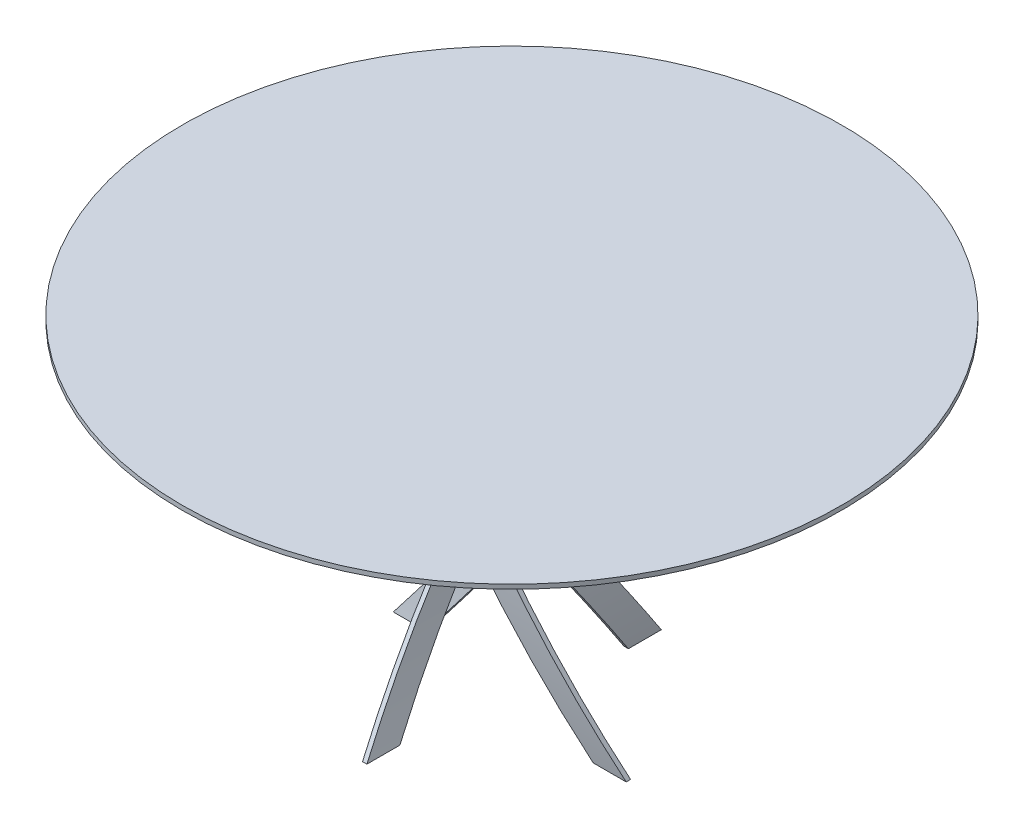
ISO-10303-21;
HEADER;
FILE_DESCRIPTION(('STEP AP214'),'2;1');
FILE_NAME('part.step','',(''),(''),'','','');
FILE_SCHEMA(('AUTOMOTIVE_DESIGN { 1 0 10303 214 1 1 1 1 }'));
ENDSEC;
DATA;
#1=APPLICATION_CONTEXT('core data for automotive mechanical design processes');
#2=APPLICATION_PROTOCOL_DEFINITION('international standard','automotive_design',2000,#1);
#3=PRODUCT_CONTEXT('',#1,'mechanical');
#4=PRODUCT('Part','Part','',(#3));
#5=PRODUCT_RELATED_PRODUCT_CATEGORY('part','',(#4));
#6=PRODUCT_DEFINITION_FORMATION('','',#4);
#7=PRODUCT_DEFINITION_CONTEXT('part definition',#1,'design');
#8=PRODUCT_DEFINITION('design','',#6,#7);
#9=PRODUCT_DEFINITION_SHAPE('','',#8);
#10=(LENGTH_UNIT() NAMED_UNIT(*) SI_UNIT(.MILLI.,.METRE.));
#11=(NAMED_UNIT(*) PLANE_ANGLE_UNIT() SI_UNIT($,.RADIAN.));
#12=(NAMED_UNIT(*) SI_UNIT($,.STERADIAN.) SOLID_ANGLE_UNIT());
#13=UNCERTAINTY_MEASURE_WITH_UNIT(LENGTH_MEASURE(1.E-05),#10,'distance_accuracy_value','');
#14=(GEOMETRIC_REPRESENTATION_CONTEXT(3) GLOBAL_UNCERTAINTY_ASSIGNED_CONTEXT((#13)) GLOBAL_UNIT_ASSIGNED_CONTEXT((#10,
#11,#12)) REPRESENTATION_CONTEXT('',''));
#15=CARTESIAN_POINT('',(0.,0.,0.));
#16=DIRECTION('',(0.,0.,1.));
#17=DIRECTION('',(1.,0.,0.));
#18=AXIS2_PLACEMENT_3D('',#15,#16,#17);
#19=CARTESIAN_POINT('',(-300.000000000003,-1.11022302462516E-13,299.999999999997));
#20=DIRECTION('',(0.,0.589469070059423,0.807790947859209));
#21=DIRECTION('',(0.,-0.807790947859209,0.589469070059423));
#22=AXIS2_PLACEMENT_3D('',#19,#20,#21);
#23=PLANE('',#22);
#24=DIRECTION('',(1.,0.,0.));
#25=VECTOR('',#24,1.);
#26=CARTESIAN_POINT('',(-299.999999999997,740.,-240.000000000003));
#27=LINE('',#26,#25);
#28=CARTESIAN_POINT('',(-39.9999999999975,740.,-240.));
#29=VERTEX_POINT('',#28);
#30=CARTESIAN_POINT('',(-29.9999999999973,740.,-240.));
#31=VERTEX_POINT('',#30);
#32=EDGE_CURVE('E109',#29,#31,#27,.T.);
#33=ORIENTED_EDGE('',*,*,#32,.F.);
#34=CARTESIAN_POINT('',(1721.56180703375,370.,30.0000000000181));
#35=DIRECTION('',(0.,0.589469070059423,0.807790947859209));
#36=DIRECTION('',(0.,0.807790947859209,-0.589469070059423));
#37=AXIS2_PLACEMENT_3D('',#34,#35,#36);
#38=ELLIPSE('',#37,2228.29929546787,1800.);
#39=CARTESIAN_POINT('',(-40.0000000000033,-1.11022302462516E-13,300.));
#40=VERTEX_POINT('',#39);
#41=EDGE_CURVE('E91',#29,#40,#38,.T.);
#42=ORIENTED_EDGE('',*,*,#41,.T.);
#43=DIRECTION('',(1.,0.,0.));
#44=VECTOR('',#43,1.);
#45=CARTESIAN_POINT('',(-300.000000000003,-1.11022302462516E-13,299.999999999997));
#46=LINE('',#45,#44);
#47=CARTESIAN_POINT('',(-30.0000000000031,-1.11022302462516E-13,300.));
#48=VERTEX_POINT('',#47);
#49=EDGE_CURVE('E111',#40,#48,#46,.T.);
#50=ORIENTED_EDGE('',*,*,#49,.T.);
#51=CARTESIAN_POINT('',(1731.56180703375,370.,30.0000000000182));
#52=DIRECTION('',(0.,0.589469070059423,0.807790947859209));
#53=DIRECTION('',(0.,0.807790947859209,-0.589469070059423));
#54=AXIS2_PLACEMENT_3D('',#51,#52,#53);
#55=ELLIPSE('',#54,2228.29929546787,1800.);
#56=EDGE_CURVE('E96',#48,#31,#55,.F.);
#57=ORIENTED_EDGE('',*,*,#56,.T.);
#58=EDGE_LOOP('',(#33,#42,#50,#57));
#59=FACE_BOUND('',#58,.T.);
#60=ADVANCED_FACE('F46',(#59),#23,.T.);
#61=CARTESIAN_POINT('',(1721.56180703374,370.,500.000000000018));
#62=DIRECTION('',(0.,0.,-1.));
#63=DIRECTION('',(-1.,0.,0.));
#64=AXIS2_PLACEMENT_3D('',#61,#62,#63);
#65=CYLINDRICAL_SURFACE('',#64,1800.);
#66=ORIENTED_EDGE('',*,*,#41,.F.);
#67=CARTESIAN_POINT('',(1721.56180703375,370.,-239.999999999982));
#68=DIRECTION('',(0.,0.,-1.));
#69=DIRECTION('',(0.,1.,0.));
#70=AXIS2_PLACEMENT_3D('',#67,#68,#69);
#71=CIRCLE('',#70,1800.);
#72=CARTESIAN_POINT('',(-58.4922044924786,637.222222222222,-240.000000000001));
#73=VERTEX_POINT('',#72);
#74=EDGE_CURVE('E87',#73,#29,#71,.T.);
#75=ORIENTED_EDGE('',*,*,#74,.F.);
#76=CARTESIAN_POINT('',(1721.56180703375,370.,-44.9999999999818));
#77=DIRECTION('',(0.,-0.589469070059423,-0.807790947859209));
#78=DIRECTION('',(0.,0.807790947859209,-0.589469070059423));
#79=AXIS2_PLACEMENT_3D('',#76,#77,#78);
#80=ELLIPSE('',#79,2228.29929546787,1800.);
#81=CARTESIAN_POINT('',(-40.0000000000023,-1.11022302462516E-13,225.));
#82=VERTEX_POINT('',#81);
#83=EDGE_CURVE('E50',#82,#73,#80,.T.);
#84=ORIENTED_EDGE('',*,*,#83,.F.);
#85=DIRECTION('',(0.,0.,-1.));
#86=VECTOR('',#85,1.);
#87=CARTESIAN_POINT('',(-40.0000000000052,0.,500.));
#88=LINE('',#87,#86);
#89=EDGE_CURVE('E70',#40,#82,#88,.T.);
#90=ORIENTED_EDGE('',*,*,#89,.F.);
#91=EDGE_LOOP('',(#66,#75,#84,#90));
#92=FACE_BOUND('',#91,.T.);
#93=ADVANCED_FACE('F89',(#92),#65,.T.);
#94=CARTESIAN_POINT('',(-299.999999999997,637.222222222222,-240.000000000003));
#95=DIRECTION('',(0.,-0.589469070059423,-0.807790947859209));
#96=DIRECTION('',(0.,0.807790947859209,-0.589469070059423));
#97=AXIS2_PLACEMENT_3D('',#94,#95,#96);
#98=PLANE('',#97);
#99=DIRECTION('',(1.,0.,0.));
#100=VECTOR('',#99,1.);
#101=CARTESIAN_POINT('',(-300.000000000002,-1.11022302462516E-13,224.999999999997));
#102=LINE('',#101,#100);
#103=CARTESIAN_POINT('',(-30.0000000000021,-1.11022302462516E-13,225.));
#104=VERTEX_POINT('',#103);
#105=EDGE_CURVE('E12',#82,#104,#102,.T.);
#106=ORIENTED_EDGE('',*,*,#105,.F.);
#107=ORIENTED_EDGE('',*,*,#83,.T.);
#108=DIRECTION('',(1.,0.,0.));
#109=VECTOR('',#108,1.);
#110=CARTESIAN_POINT('',(-299.999999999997,637.222222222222,-240.000000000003));
#111=LINE('',#110,#109);
#112=CARTESIAN_POINT('',(-48.4922044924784,637.222222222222,-240.));
#113=VERTEX_POINT('',#112);
#114=EDGE_CURVE('E55',#73,#113,#111,.T.);
#115=ORIENTED_EDGE('',*,*,#114,.T.);
#116=CARTESIAN_POINT('',(1731.56180703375,370.,-44.9999999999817));
#117=DIRECTION('',(0.,-0.589469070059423,-0.807790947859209));
#118=DIRECTION('',(0.,0.807790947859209,-0.589469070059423));
#119=AXIS2_PLACEMENT_3D('',#116,#117,#118);
#120=ELLIPSE('',#119,2228.29929546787,1800.);
#121=EDGE_CURVE('E101',#113,#104,#120,.F.);
#122=ORIENTED_EDGE('',*,*,#121,.T.);
#123=EDGE_LOOP('',(#106,#107,#115,#122));
#124=FACE_BOUND('',#123,.T.);
#125=ADVANCED_FACE('F48',(#124),#98,.T.);
#126=CARTESIAN_POINT('',(-299.999999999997,740.,-240.000000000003));
#127=DIRECTION('',(0.,0.,-1.));
#128=DIRECTION('',(0.,1.,0.));
#129=AXIS2_PLACEMENT_3D('',#126,#127,#128);
#130=PLANE('',#129);
#131=ORIENTED_EDGE('',*,*,#114,.F.);
#132=ORIENTED_EDGE('',*,*,#74,.T.);
#133=ORIENTED_EDGE('',*,*,#32,.T.);
#134=CARTESIAN_POINT('',(1731.56180703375,370.,-239.999999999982));
#135=DIRECTION('',(0.,0.,-1.));
#136=DIRECTION('',(0.,1.,0.));
#137=AXIS2_PLACEMENT_3D('',#134,#135,#136);
#138=CIRCLE('',#137,1800.);
#139=EDGE_CURVE('E97',#31,#113,#138,.F.);
#140=ORIENTED_EDGE('',*,*,#139,.T.);
#141=EDGE_LOOP('',(#131,#132,#133,#140));
#142=FACE_BOUND('',#141,.T.);
#143=ADVANCED_FACE('F102',(#142),#130,.T.);
#144=CARTESIAN_POINT('',(1731.56180703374,370.,500.000000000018));
#145=DIRECTION('',(0.,0.,-1.));
#146=DIRECTION('',(-1.,0.,0.));
#147=AXIS2_PLACEMENT_3D('',#144,#145,#146);
#148=CYLINDRICAL_SURFACE('',#147,1800.);
#149=ORIENTED_EDGE('',*,*,#56,.F.);
#150=DIRECTION('',(0.,0.,-1.));
#151=VECTOR('',#150,1.);
#152=CARTESIAN_POINT('',(-30.0000000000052,0.,500.));
#153=LINE('',#152,#151);
#154=EDGE_CURVE('E62',#48,#104,#153,.T.);
#155=ORIENTED_EDGE('',*,*,#154,.T.);
#156=ORIENTED_EDGE('',*,*,#121,.F.);
#157=ORIENTED_EDGE('',*,*,#139,.F.);
#158=EDGE_LOOP('',(#149,#155,#156,#157));
#159=FACE_BOUND('',#158,.T.);
#160=ADVANCED_FACE('F122',(#159),#148,.F.);
#161=CARTESIAN_POINT('',(-300.000000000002,-1.11022302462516E-13,224.999999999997));
#162=DIRECTION('',(0.,-1.,0.));
#163=DIRECTION('',(-1.,0.,0.));
#164=AXIS2_PLACEMENT_3D('',#161,#162,#163);
#165=PLANE('',#164);
#166=ORIENTED_EDGE('',*,*,#49,.F.);
#167=ORIENTED_EDGE('',*,*,#89,.T.);
#168=ORIENTED_EDGE('',*,*,#105,.T.);
#169=ORIENTED_EDGE('',*,*,#154,.F.);
#170=EDGE_LOOP('',(#166,#167,#168,#169));
#171=FACE_BOUND('',#170,.T.);
#172=ADVANCED_FACE('F119',(#171),#165,.T.);
#173=CLOSED_SHELL('',(#60,#93,#125,#143,#160,#172));
#174=MANIFOLD_SOLID_BREP('B2',#173);
#175=CARTESIAN_POINT('',(300.,-1.11022302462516E-13,300.));
#176=DIRECTION('',(0.807790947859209,0.589469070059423,0.));
#177=DIRECTION('',(0.589469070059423,-0.807790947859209,0.));
#178=AXIS2_PLACEMENT_3D('',#175,#176,#177);
#179=PLANE('',#178);
#180=DIRECTION('',(0.,0.,-1.));
#181=VECTOR('',#180,1.);
#182=CARTESIAN_POINT('',(-240.,740.,300.));
#183=LINE('',#182,#181);
#184=CARTESIAN_POINT('',(-240.,740.,40.));
#185=VERTEX_POINT('',#184);
#186=CARTESIAN_POINT('',(-240.,740.,29.9999999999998));
#187=VERTEX_POINT('',#186);
#188=EDGE_CURVE('E255',#185,#187,#183,.T.);
#189=ORIENTED_EDGE('',*,*,#188,.F.);
#190=CARTESIAN_POINT('',(30.,370.,-1721.56180703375));
#191=DIRECTION('',(0.807790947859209,0.589469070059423,0.));
#192=DIRECTION('',(-0.589469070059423,0.807790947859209,0.));
#193=AXIS2_PLACEMENT_3D('',#190,#191,#192);
#194=ELLIPSE('',#193,2228.29929546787,1800.);
#195=CARTESIAN_POINT('',(300.,-1.11022302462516E-13,40.0000000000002));
#196=VERTEX_POINT('',#195);
#197=EDGE_CURVE('E237',#185,#196,#194,.T.);
#198=ORIENTED_EDGE('',*,*,#197,.T.);
#199=DIRECTION('',(0.,0.,-1.));
#200=VECTOR('',#199,1.);
#201=CARTESIAN_POINT('',(300.,-1.11022302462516E-13,300.));
#202=LINE('',#201,#200);
#203=CARTESIAN_POINT('',(300.,-1.11022302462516E-13,30.));
#204=VERTEX_POINT('',#203);
#205=EDGE_CURVE('E257',#196,#204,#202,.T.);
#206=ORIENTED_EDGE('',*,*,#205,.T.);
#207=CARTESIAN_POINT('',(30.,370.,-1731.56180703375));
#208=DIRECTION('',(0.807790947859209,0.589469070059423,0.));
#209=DIRECTION('',(-0.589469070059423,0.807790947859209,0.));
#210=AXIS2_PLACEMENT_3D('',#207,#208,#209);
#211=ELLIPSE('',#210,2228.29929546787,1800.);
#212=EDGE_CURVE('E242',#204,#187,#211,.F.);
#213=ORIENTED_EDGE('',*,*,#212,.T.);
#214=EDGE_LOOP('',(#189,#198,#206,#213));
#215=FACE_BOUND('',#214,.T.);
#216=ADVANCED_FACE('F192',(#215),#179,.T.);
#217=CARTESIAN_POINT('',(500.,370.,-1721.56180703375));
#218=DIRECTION('',(-1.,0.,0.));
#219=DIRECTION('',(0.,0.,1.));
#220=AXIS2_PLACEMENT_3D('',#217,#218,#219);
#221=CYLINDRICAL_SURFACE('',#220,1800.);
#222=ORIENTED_EDGE('',*,*,#197,.F.);
#223=CARTESIAN_POINT('',(-240.,370.,-1721.56180703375));
#224=DIRECTION('',(-1.,0.,0.));
#225=DIRECTION('',(0.,1.,0.));
#226=AXIS2_PLACEMENT_3D('',#223,#224,#225);
#227=CIRCLE('',#226,1800.);
#228=CARTESIAN_POINT('',(-240.,637.222222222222,58.4922044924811));
#229=VERTEX_POINT('',#228);
#230=EDGE_CURVE('E233',#229,#185,#227,.T.);
#231=ORIENTED_EDGE('',*,*,#230,.F.);
#232=CARTESIAN_POINT('',(-44.9999999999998,370.,-1721.56180703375));
#233=DIRECTION('',(-0.807790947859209,-0.589469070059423,0.));
#234=DIRECTION('',(-0.589469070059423,0.807790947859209,0.));
#235=AXIS2_PLACEMENT_3D('',#232,#233,#234);
#236=ELLIPSE('',#235,2228.29929546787,1800.);
#237=CARTESIAN_POINT('',(225.,-1.11022302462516E-13,40.));
#238=VERTEX_POINT('',#237);
#239=EDGE_CURVE('E196',#238,#229,#236,.T.);
#240=ORIENTED_EDGE('',*,*,#239,.F.);
#241=DIRECTION('',(-1.,0.,0.));
#242=VECTOR('',#241,1.);
#243=CARTESIAN_POINT('',(500.,0.,40.));
#244=LINE('',#243,#242);
#245=EDGE_CURVE('E216',#196,#238,#244,.T.);
#246=ORIENTED_EDGE('',*,*,#245,.F.);
#247=EDGE_LOOP('',(#222,#231,#240,#246));
#248=FACE_BOUND('',#247,.T.);
#249=ADVANCED_FACE('F235',(#248),#221,.T.);
#250=CARTESIAN_POINT('',(-240.,637.222222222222,300.));
#251=DIRECTION('',(-0.807790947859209,-0.589469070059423,0.));
#252=DIRECTION('',(-0.589469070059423,0.807790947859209,0.));
#253=AXIS2_PLACEMENT_3D('',#250,#251,#252);
#254=PLANE('',#253);
#255=DIRECTION('',(0.,0.,-1.));
#256=VECTOR('',#255,1.);
#257=CARTESIAN_POINT('',(225.,-1.11022302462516E-13,300.));
#258=LINE('',#257,#256);
#259=CARTESIAN_POINT('',(225.,-1.11022302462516E-13,29.9999999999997));
#260=VERTEX_POINT('',#259);
#261=EDGE_CURVE('E44',#238,#260,#258,.T.);
#262=ORIENTED_EDGE('',*,*,#261,.F.);
#263=ORIENTED_EDGE('',*,*,#239,.T.);
#264=DIRECTION('',(0.,0.,-1.));
#265=VECTOR('',#264,1.);
#266=CARTESIAN_POINT('',(-240.,637.222222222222,300.));
#267=LINE('',#266,#265);
#268=CARTESIAN_POINT('',(-240.,637.222222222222,48.4922044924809));
#269=VERTEX_POINT('',#268);
#270=EDGE_CURVE('E201',#229,#269,#267,.T.);
#271=ORIENTED_EDGE('',*,*,#270,.T.);
#272=CARTESIAN_POINT('',(-44.9999999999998,370.,-1731.56180703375));
#273=DIRECTION('',(-0.807790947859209,-0.589469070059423,0.));
#274=DIRECTION('',(-0.589469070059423,0.807790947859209,0.));
#275=AXIS2_PLACEMENT_3D('',#272,#273,#274);
#276=ELLIPSE('',#275,2228.29929546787,1800.);
#277=EDGE_CURVE('E247',#269,#260,#276,.F.);
#278=ORIENTED_EDGE('',*,*,#277,.T.);
#279=EDGE_LOOP('',(#262,#263,#271,#278));
#280=FACE_BOUND('',#279,.T.);
#281=ADVANCED_FACE('F194',(#280),#254,.T.);
#282=CARTESIAN_POINT('',(-240.,740.,300.));
#283=DIRECTION('',(-1.,0.,0.));
#284=DIRECTION('',(0.,1.,0.));
#285=AXIS2_PLACEMENT_3D('',#282,#283,#284);
#286=PLANE('',#285);
#287=ORIENTED_EDGE('',*,*,#270,.F.);
#288=ORIENTED_EDGE('',*,*,#230,.T.);
#289=ORIENTED_EDGE('',*,*,#188,.T.);
#290=CARTESIAN_POINT('',(-240.,370.,-1731.56180703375));
#291=DIRECTION('',(-1.,0.,0.));
#292=DIRECTION('',(0.,1.,0.));
#293=AXIS2_PLACEMENT_3D('',#290,#291,#292);
#294=CIRCLE('',#293,1800.);
#295=EDGE_CURVE('E243',#187,#269,#294,.F.);
#296=ORIENTED_EDGE('',*,*,#295,.T.);
#297=EDGE_LOOP('',(#287,#288,#289,#296));
#298=FACE_BOUND('',#297,.T.);
#299=ADVANCED_FACE('F248',(#298),#286,.T.);
#300=CARTESIAN_POINT('',(500.,370.,-1731.56180703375));
#301=DIRECTION('',(-1.,0.,0.));
#302=DIRECTION('',(0.,0.,1.));
#303=AXIS2_PLACEMENT_3D('',#300,#301,#302);
#304=CYLINDRICAL_SURFACE('',#303,1800.);
#305=ORIENTED_EDGE('',*,*,#212,.F.);
#306=DIRECTION('',(-1.,0.,0.));
#307=VECTOR('',#306,1.);
#308=CARTESIAN_POINT('',(500.,0.,30.));
#309=LINE('',#308,#307);
#310=EDGE_CURVE('E208',#204,#260,#309,.T.);
#311=ORIENTED_EDGE('',*,*,#310,.T.);
#312=ORIENTED_EDGE('',*,*,#277,.F.);
#313=ORIENTED_EDGE('',*,*,#295,.F.);
#314=EDGE_LOOP('',(#305,#311,#312,#313));
#315=FACE_BOUND('',#314,.T.);
#316=ADVANCED_FACE('F268',(#315),#304,.F.);
#317=CARTESIAN_POINT('',(225.,-1.11022302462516E-13,300.));
#318=DIRECTION('',(0.,-1.,0.));
#319=DIRECTION('',(0.,0.,1.));
#320=AXIS2_PLACEMENT_3D('',#317,#318,#319);
#321=PLANE('',#320);
#322=ORIENTED_EDGE('',*,*,#205,.F.);
#323=ORIENTED_EDGE('',*,*,#245,.T.);
#324=ORIENTED_EDGE('',*,*,#261,.T.);
#325=ORIENTED_EDGE('',*,*,#310,.F.);
#326=EDGE_LOOP('',(#322,#323,#324,#325));
#327=FACE_BOUND('',#326,.T.);
#328=ADVANCED_FACE('F265',(#327),#321,.T.);
#329=CLOSED_SHELL('',(#216,#249,#281,#299,#316,#328));
#330=MANIFOLD_SOLID_BREP('B6',#329);
#331=CARTESIAN_POINT('',(300.000000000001,-1.11022302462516E-13,-299.999999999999));
#332=DIRECTION('',(0.,0.589469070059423,-0.807790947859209));
#333=DIRECTION('',(0.,-0.807790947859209,-0.589469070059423));
#334=AXIS2_PLACEMENT_3D('',#331,#332,#333);
#335=PLANE('',#334);
#336=DIRECTION('',(-1.,0.,0.));
#337=VECTOR('',#336,1.);
#338=CARTESIAN_POINT('',(299.999999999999,740.,240.000000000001));
#339=LINE('',#338,#337);
#340=CARTESIAN_POINT('',(39.9999999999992,740.,240.));
#341=VERTEX_POINT('',#340);
#342=CARTESIAN_POINT('',(29.999999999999,740.,240.));
#343=VERTEX_POINT('',#342);
#344=EDGE_CURVE('E401',#341,#343,#339,.T.);
#345=ORIENTED_EDGE('',*,*,#344,.F.);
#346=CARTESIAN_POINT('',(-1721.56180703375,370.,-30.000000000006));
#347=DIRECTION('',(0.,0.589469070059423,-0.807790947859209));
#348=DIRECTION('',(0.,0.807790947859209,0.589469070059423));
#349=AXIS2_PLACEMENT_3D('',#346,#347,#348);
#350=ELLIPSE('',#349,2228.29929546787,1800.);
#351=CARTESIAN_POINT('',(40.0000000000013,-1.11022302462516E-13,-300.));
#352=VERTEX_POINT('',#351);
#353=EDGE_CURVE('E383',#341,#352,#350,.T.);
#354=ORIENTED_EDGE('',*,*,#353,.T.);
#355=DIRECTION('',(-1.,0.,0.));
#356=VECTOR('',#355,1.);
#357=CARTESIAN_POINT('',(300.000000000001,-1.11022302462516E-13,-299.999999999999));
#358=LINE('',#357,#356);
#359=CARTESIAN_POINT('',(30.000000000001,-1.11022302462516E-13,-300.));
#360=VERTEX_POINT('',#359);
#361=EDGE_CURVE('E403',#352,#360,#358,.T.);
#362=ORIENTED_EDGE('',*,*,#361,.T.);
#363=CARTESIAN_POINT('',(-1731.56180703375,370.,-30.0000000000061));
#364=DIRECTION('',(0.,0.589469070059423,-0.807790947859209));
#365=DIRECTION('',(0.,0.807790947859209,0.589469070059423));
#366=AXIS2_PLACEMENT_3D('',#363,#364,#365);
#367=ELLIPSE('',#366,2228.29929546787,1800.);
#368=EDGE_CURVE('E388',#360,#343,#367,.F.);
#369=ORIENTED_EDGE('',*,*,#368,.T.);
#370=EDGE_LOOP('',(#345,#354,#362,#369));
#371=FACE_BOUND('',#370,.T.);
#372=ADVANCED_FACE('F338',(#371),#335,.T.);
#373=CARTESIAN_POINT('',(-1721.56180703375,370.,-500.000000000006));
#374=DIRECTION('',(0.,0.,1.));
#375=DIRECTION('',(1.,0.,0.));
#376=AXIS2_PLACEMENT_3D('',#373,#374,#375);
#377=CYLINDRICAL_SURFACE('',#376,1800.);
#378=ORIENTED_EDGE('',*,*,#353,.F.);
#379=CARTESIAN_POINT('',(-1721.56180703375,370.,239.999999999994));
#380=DIRECTION('',(0.,0.,1.));
#381=DIRECTION('',(0.,1.,0.));
#382=AXIS2_PLACEMENT_3D('',#379,#380,#381);
#383=CIRCLE('',#382,1800.);
#384=CARTESIAN_POINT('',(58.4922044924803,637.222222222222,240.));
#385=VERTEX_POINT('',#384);
#386=EDGE_CURVE('E379',#385,#341,#383,.T.);
#387=ORIENTED_EDGE('',*,*,#386,.F.);
#388=CARTESIAN_POINT('',(-1721.56180703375,370.,44.9999999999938));
#389=DIRECTION('',(0.,-0.589469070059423,0.807790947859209));
#390=DIRECTION('',(0.,0.807790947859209,0.589469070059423));
#391=AXIS2_PLACEMENT_3D('',#388,#389,#390);
#392=ELLIPSE('',#391,2228.29929546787,1800.);
#393=CARTESIAN_POINT('',(40.0000000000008,-1.11022302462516E-13,-225.));
#394=VERTEX_POINT('',#393);
#395=EDGE_CURVE('E342',#394,#385,#392,.T.);
#396=ORIENTED_EDGE('',*,*,#395,.F.);
#397=DIRECTION('',(0.,0.,1.));
#398=VECTOR('',#397,1.);
#399=CARTESIAN_POINT('',(40.0000000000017,0.,-500.));
#400=LINE('',#399,#398);
#401=EDGE_CURVE('E362',#352,#394,#400,.T.);
#402=ORIENTED_EDGE('',*,*,#401,.F.);
#403=EDGE_LOOP('',(#378,#387,#396,#402));
#404=FACE_BOUND('',#403,.T.);
#405=ADVANCED_FACE('F381',(#404),#377,.T.);
#406=CARTESIAN_POINT('',(299.999999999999,637.222222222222,240.000000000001));
#407=DIRECTION('',(0.,-0.589469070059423,0.807790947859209));
#408=DIRECTION('',(0.,0.807790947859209,0.589469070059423));
#409=AXIS2_PLACEMENT_3D('',#406,#407,#408);
#410=PLANE('',#409);
#411=DIRECTION('',(-1.,0.,0.));
#412=VECTOR('',#411,1.);
#413=CARTESIAN_POINT('',(300.000000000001,-1.11022302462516E-13,-224.999999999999));
#414=LINE('',#413,#412);
#415=CARTESIAN_POINT('',(30.0000000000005,-1.11022302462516E-13,-225.));
#416=VERTEX_POINT('',#415);
#417=EDGE_CURVE('E190',#394,#416,#414,.T.);
#418=ORIENTED_EDGE('',*,*,#417,.F.);
#419=ORIENTED_EDGE('',*,*,#395,.T.);
#420=DIRECTION('',(-1.,0.,0.));
#421=VECTOR('',#420,1.);
#422=CARTESIAN_POINT('',(299.999999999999,637.222222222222,240.000000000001));
#423=LINE('',#422,#421);
#424=CARTESIAN_POINT('',(48.49220449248,637.222222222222,240.));
#425=VERTEX_POINT('',#424);
#426=EDGE_CURVE('E347',#385,#425,#423,.T.);
#427=ORIENTED_EDGE('',*,*,#426,.T.);
#428=CARTESIAN_POINT('',(-1731.56180703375,370.,44.9999999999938));
#429=DIRECTION('',(0.,-0.589469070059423,0.807790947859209));
#430=DIRECTION('',(0.,0.807790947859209,0.589469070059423));
#431=AXIS2_PLACEMENT_3D('',#428,#429,#430);
#432=ELLIPSE('',#431,2228.29929546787,1800.);
#433=EDGE_CURVE('E393',#425,#416,#432,.F.);
#434=ORIENTED_EDGE('',*,*,#433,.T.);
#435=EDGE_LOOP('',(#418,#419,#427,#434));
#436=FACE_BOUND('',#435,.T.);
#437=ADVANCED_FACE('F340',(#436),#410,.T.);
#438=CARTESIAN_POINT('',(299.999999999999,740.,240.000000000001));
#439=DIRECTION('',(0.,0.,1.));
#440=DIRECTION('',(0.,1.,0.));
#441=AXIS2_PLACEMENT_3D('',#438,#439,#440);
#442=PLANE('',#441);
#443=ORIENTED_EDGE('',*,*,#426,.F.);
#444=ORIENTED_EDGE('',*,*,#386,.T.);
#445=ORIENTED_EDGE('',*,*,#344,.T.);
#446=CARTESIAN_POINT('',(-1731.56180703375,370.,239.999999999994));
#447=DIRECTION('',(0.,0.,1.));
#448=DIRECTION('',(0.,1.,0.));
#449=AXIS2_PLACEMENT_3D('',#446,#447,#448);
#450=CIRCLE('',#449,1800.);
#451=EDGE_CURVE('E389',#343,#425,#450,.F.);
#452=ORIENTED_EDGE('',*,*,#451,.T.);
#453=EDGE_LOOP('',(#443,#444,#445,#452));
#454=FACE_BOUND('',#453,.T.);
#455=ADVANCED_FACE('F394',(#454),#442,.T.);
#456=CARTESIAN_POINT('',(-1731.56180703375,370.,-500.000000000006));
#457=DIRECTION('',(0.,0.,1.));
#458=DIRECTION('',(1.,0.,0.));
#459=AXIS2_PLACEMENT_3D('',#456,#457,#458);
#460=CYLINDRICAL_SURFACE('',#459,1800.);
#461=ORIENTED_EDGE('',*,*,#368,.F.);
#462=DIRECTION('',(0.,0.,1.));
#463=VECTOR('',#462,1.);
#464=CARTESIAN_POINT('',(30.0000000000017,0.,-500.));
#465=LINE('',#464,#463);
#466=EDGE_CURVE('E354',#360,#416,#465,.T.);
#467=ORIENTED_EDGE('',*,*,#466,.T.);
#468=ORIENTED_EDGE('',*,*,#433,.F.);
#469=ORIENTED_EDGE('',*,*,#451,.F.);
#470=EDGE_LOOP('',(#461,#467,#468,#469));
#471=FACE_BOUND('',#470,.T.);
#472=ADVANCED_FACE('F414',(#471),#460,.F.);
#473=CARTESIAN_POINT('',(300.000000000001,-1.11022302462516E-13,-224.999999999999));
#474=DIRECTION('',(0.,-1.,0.));
#475=DIRECTION('',(1.,0.,0.));
#476=AXIS2_PLACEMENT_3D('',#473,#474,#475);
#477=PLANE('',#476);
#478=ORIENTED_EDGE('',*,*,#361,.F.);
#479=ORIENTED_EDGE('',*,*,#401,.T.);
#480=ORIENTED_EDGE('',*,*,#417,.T.);
#481=ORIENTED_EDGE('',*,*,#466,.F.);
#482=EDGE_LOOP('',(#478,#479,#480,#481));
#483=FACE_BOUND('',#482,.T.);
#484=ADVANCED_FACE('F411',(#483),#477,.T.);
#485=CLOSED_SHELL('',(#372,#405,#437,#455,#472,#484));
#486=MANIFOLD_SOLID_BREP('B38',#485);
#487=CARTESIAN_POINT('',(-300.,-1.11022302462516E-13,-300.));
#488=DIRECTION('',(-0.807790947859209,0.589469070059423,0.));
#489=DIRECTION('',(-0.589469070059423,-0.807790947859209,0.));
#490=AXIS2_PLACEMENT_3D('',#487,#488,#489);
#491=PLANE('',#490);
#492=DIRECTION('',(0.,0.,1.));
#493=VECTOR('',#492,1.);
#494=CARTESIAN_POINT('',(240.,740.,-300.));
#495=LINE('',#494,#493);
#496=CARTESIAN_POINT('',(240.,740.,-40.));
#497=VERTEX_POINT('',#496);
#498=CARTESIAN_POINT('',(240.,740.,-29.9999999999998));
#499=VERTEX_POINT('',#498);
#500=EDGE_CURVE('E544',#497,#499,#495,.T.);
#501=ORIENTED_EDGE('',*,*,#500,.F.);
#502=CARTESIAN_POINT('',(-30.,370.,1721.56180703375));
#503=DIRECTION('',(-0.807790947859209,0.589469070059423,0.));
#504=DIRECTION('',(0.589469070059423,0.807790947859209,0.));
#505=AXIS2_PLACEMENT_3D('',#502,#503,#504);
#506=ELLIPSE('',#505,2228.29929546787,1800.);
#507=CARTESIAN_POINT('',(-300.,-1.11022302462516E-13,-40.0000000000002));
#508=VERTEX_POINT('',#507);
#509=EDGE_CURVE('E526',#497,#508,#506,.T.);
#510=ORIENTED_EDGE('',*,*,#509,.T.);
#511=DIRECTION('',(0.,0.,1.));
#512=VECTOR('',#511,1.);
#513=CARTESIAN_POINT('',(-300.,-1.11022302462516E-13,-300.));
#514=LINE('',#513,#512);
#515=CARTESIAN_POINT('',(-300.,-1.11022302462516E-13,-30.));
#516=VERTEX_POINT('',#515);
#517=EDGE_CURVE('E546',#508,#516,#514,.T.);
#518=ORIENTED_EDGE('',*,*,#517,.T.);
#519=CARTESIAN_POINT('',(-30.,370.,1731.56180703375));
#520=DIRECTION('',(-0.807790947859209,0.589469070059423,0.));
#521=DIRECTION('',(0.589469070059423,0.807790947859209,0.));
#522=AXIS2_PLACEMENT_3D('',#519,#520,#521);
#523=ELLIPSE('',#522,2228.29929546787,1800.);
#524=EDGE_CURVE('E531',#516,#499,#523,.F.);
#525=ORIENTED_EDGE('',*,*,#524,.T.);
#526=EDGE_LOOP('',(#501,#510,#518,#525));
#527=FACE_BOUND('',#526,.T.);
#528=ADVANCED_FACE('F481',(#527),#491,.T.);
#529=CARTESIAN_POINT('',(-500.,370.,1721.56180703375));
#530=DIRECTION('',(1.,0.,0.));
#531=DIRECTION('',(0.,0.,-1.));
#532=AXIS2_PLACEMENT_3D('',#529,#530,#531);
#533=CYLINDRICAL_SURFACE('',#532,1800.);
#534=ORIENTED_EDGE('',*,*,#509,.F.);
#535=CARTESIAN_POINT('',(240.,370.,1721.56180703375));
#536=DIRECTION('',(1.,0.,0.));
#537=DIRECTION('',(0.,1.,0.));
#538=AXIS2_PLACEMENT_3D('',#535,#536,#537);
#539=CIRCLE('',#538,1800.);
#540=CARTESIAN_POINT('',(240.,637.222222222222,-58.4922044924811));
#541=VERTEX_POINT('',#540);
#542=EDGE_CURVE('E522',#541,#497,#539,.T.);
#543=ORIENTED_EDGE('',*,*,#542,.F.);
#544=CARTESIAN_POINT('',(44.9999999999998,370.,1721.56180703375));
#545=DIRECTION('',(0.807790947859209,-0.589469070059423,0.));
#546=DIRECTION('',(0.589469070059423,0.807790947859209,0.));
#547=AXIS2_PLACEMENT_3D('',#544,#545,#546);
#548=ELLIPSE('',#547,2228.29929546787,1800.);
#549=CARTESIAN_POINT('',(-225.,-1.11022302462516E-13,-40.));
#550=VERTEX_POINT('',#549);
#551=EDGE_CURVE('E485',#550,#541,#548,.T.);
#552=ORIENTED_EDGE('',*,*,#551,.F.);
#553=DIRECTION('',(1.,0.,0.));
#554=VECTOR('',#553,1.);
#555=CARTESIAN_POINT('',(-500.,0.,-40.));
#556=LINE('',#555,#554);
#557=EDGE_CURVE('E505',#508,#550,#556,.T.);
#558=ORIENTED_EDGE('',*,*,#557,.F.);
#559=EDGE_LOOP('',(#534,#543,#552,#558));
#560=FACE_BOUND('',#559,.T.);
#561=ADVANCED_FACE('F524',(#560),#533,.T.);
#562=CARTESIAN_POINT('',(240.,637.222222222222,-300.));
#563=DIRECTION('',(0.807790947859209,-0.589469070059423,0.));
#564=DIRECTION('',(0.589469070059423,0.807790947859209,0.));
#565=AXIS2_PLACEMENT_3D('',#562,#563,#564);
#566=PLANE('',#565);
#567=DIRECTION('',(0.,0.,1.));
#568=VECTOR('',#567,1.);
#569=CARTESIAN_POINT('',(-225.,-1.11022302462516E-13,-300.));
#570=LINE('',#569,#568);
#571=CARTESIAN_POINT('',(-225.,-1.11022302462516E-13,-29.9999999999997));
#572=VERTEX_POINT('',#571);
#573=EDGE_CURVE('E336',#550,#572,#570,.T.);
#574=ORIENTED_EDGE('',*,*,#573,.F.);
#575=ORIENTED_EDGE('',*,*,#551,.T.);
#576=DIRECTION('',(0.,0.,1.));
#577=VECTOR('',#576,1.);
#578=CARTESIAN_POINT('',(240.,637.222222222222,-300.));
#579=LINE('',#578,#577);
#580=CARTESIAN_POINT('',(240.,637.222222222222,-48.4922044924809));
#581=VERTEX_POINT('',#580);
#582=EDGE_CURVE('E490',#541,#581,#579,.T.);
#583=ORIENTED_EDGE('',*,*,#582,.T.);
#584=CARTESIAN_POINT('',(44.9999999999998,370.,1731.56180703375));
#585=DIRECTION('',(0.807790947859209,-0.589469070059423,0.));
#586=DIRECTION('',(0.589469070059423,0.807790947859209,0.));
#587=AXIS2_PLACEMENT_3D('',#584,#585,#586);
#588=ELLIPSE('',#587,2228.29929546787,1800.);
#589=EDGE_CURVE('E536',#581,#572,#588,.F.);
#590=ORIENTED_EDGE('',*,*,#589,.T.);
#591=EDGE_LOOP('',(#574,#575,#583,#590));
#592=FACE_BOUND('',#591,.T.);
#593=ADVANCED_FACE('F483',(#592),#566,.T.);
#594=CARTESIAN_POINT('',(240.,740.,-300.));
#595=DIRECTION('',(1.,0.,0.));
#596=DIRECTION('',(0.,1.,0.));
#597=AXIS2_PLACEMENT_3D('',#594,#595,#596);
#598=PLANE('',#597);
#599=ORIENTED_EDGE('',*,*,#582,.F.);
#600=ORIENTED_EDGE('',*,*,#542,.T.);
#601=ORIENTED_EDGE('',*,*,#500,.T.);
#602=CARTESIAN_POINT('',(240.,370.,1731.56180703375));
#603=DIRECTION('',(1.,0.,0.));
#604=DIRECTION('',(0.,1.,0.));
#605=AXIS2_PLACEMENT_3D('',#602,#603,#604);
#606=CIRCLE('',#605,1800.);
#607=EDGE_CURVE('E532',#499,#581,#606,.F.);
#608=ORIENTED_EDGE('',*,*,#607,.T.);
#609=EDGE_LOOP('',(#599,#600,#601,#608));
#610=FACE_BOUND('',#609,.T.);
#611=ADVANCED_FACE('F537',(#610),#598,.T.);
#612=CARTESIAN_POINT('',(-500.,370.,1731.56180703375));
#613=DIRECTION('',(1.,0.,0.));
#614=DIRECTION('',(0.,0.,-1.));
#615=AXIS2_PLACEMENT_3D('',#612,#613,#614);
#616=CYLINDRICAL_SURFACE('',#615,1800.);
#617=ORIENTED_EDGE('',*,*,#524,.F.);
#618=DIRECTION('',(1.,0.,0.));
#619=VECTOR('',#618,1.);
#620=CARTESIAN_POINT('',(-500.,0.,-30.));
#621=LINE('',#620,#619);
#622=EDGE_CURVE('E497',#516,#572,#621,.T.);
#623=ORIENTED_EDGE('',*,*,#622,.T.);
#624=ORIENTED_EDGE('',*,*,#589,.F.);
#625=ORIENTED_EDGE('',*,*,#607,.F.);
#626=EDGE_LOOP('',(#617,#623,#624,#625));
#627=FACE_BOUND('',#626,.T.);
#628=ADVANCED_FACE('F557',(#627),#616,.F.);
#629=CARTESIAN_POINT('',(-225.,-1.11022302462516E-13,-300.));
#630=DIRECTION('',(0.,-1.,0.));
#631=DIRECTION('',(0.,0.,-1.));
#632=AXIS2_PLACEMENT_3D('',#629,#630,#631);
#633=PLANE('',#632);
#634=ORIENTED_EDGE('',*,*,#517,.F.);
#635=ORIENTED_EDGE('',*,*,#557,.T.);
#636=ORIENTED_EDGE('',*,*,#573,.T.);
#637=ORIENTED_EDGE('',*,*,#622,.F.);
#638=EDGE_LOOP('',(#634,#635,#636,#637));
#639=FACE_BOUND('',#638,.T.);
#640=ADVANCED_FACE('F554',(#639),#633,.T.);
#641=CLOSED_SHELL('',(#528,#561,#593,#611,#628,#640));
#642=MANIFOLD_SOLID_BREP('B184',#641);
#643=CARTESIAN_POINT('',(0.,750.,0.));
#644=DIRECTION('',(0.,-1.,0.));
#645=DIRECTION('',(0.,0.,-1.));
#646=AXIS2_PLACEMENT_3D('',#643,#644,#645);
#647=CYLINDRICAL_SURFACE('',#646,750.);
#648=CARTESIAN_POINT('',(0.,750.,0.));
#649=DIRECTION('',(0.,1.,0.));
#650=DIRECTION('',(0.,0.,1.));
#651=AXIS2_PLACEMENT_3D('',#648,#649,#650);
#652=CIRCLE('',#651,750.);
#653=CARTESIAN_POINT('',(0.,750.,750.));
#654=VERTEX_POINT('',#653);
#655=EDGE_CURVE('E480',#654,#654,#652,.T.);
#656=ORIENTED_EDGE('',*,*,#655,.F.);
#657=EDGE_LOOP('',(#656));
#658=FACE_BOUND('',#657,.T.);
#659=CARTESIAN_POINT('',(0.,740.,0.));
#660=DIRECTION('',(0.,1.,0.));
#661=DIRECTION('',(0.,0.,1.));
#662=AXIS2_PLACEMENT_3D('',#659,#660,#661);
#663=CIRCLE('',#662,750.);
#664=CARTESIAN_POINT('',(0.,740.,750.));
#665=VERTEX_POINT('',#664);
#666=EDGE_CURVE('E608',#665,#665,#663,.T.);
#667=ORIENTED_EDGE('',*,*,#666,.T.);
#668=EDGE_LOOP('',(#667));
#669=FACE_BOUND('',#668,.T.);
#670=ADVANCED_FACE('F605',(#658,#669),#647,.T.);
#671=CARTESIAN_POINT('',(0.,750.,0.));
#672=DIRECTION('',(0.,1.,0.));
#673=DIRECTION('',(0.,0.,1.));
#674=AXIS2_PLACEMENT_3D('',#671,#672,#673);
#675=PLANE('',#674);
#676=ORIENTED_EDGE('',*,*,#655,.T.);
#677=EDGE_LOOP('',(#676));
#678=FACE_BOUND('',#677,.T.);
#679=ADVANCED_FACE('F620',(#678),#675,.T.);
#680=CARTESIAN_POINT('',(0.,740.,0.));
#681=DIRECTION('',(0.,1.,0.));
#682=DIRECTION('',(0.,0.,1.));
#683=AXIS2_PLACEMENT_3D('',#680,#681,#682);
#684=PLANE('',#683);
#685=ORIENTED_EDGE('',*,*,#666,.F.);
#686=EDGE_LOOP('',(#685));
#687=FACE_BOUND('',#686,.T.);
#688=ADVANCED_FACE('F618',(#687),#684,.F.);
#689=CLOSED_SHELL('',(#670,#679,#688));
#690=MANIFOLD_SOLID_BREP('B330',#689);
#691=ADVANCED_BREP_SHAPE_REPRESENTATION('',(#18,#174,#330,#486,#642,#690),#14);
#692=SHAPE_DEFINITION_REPRESENTATION(#9,#691);
ENDSEC;
END-ISO-10303-21;
